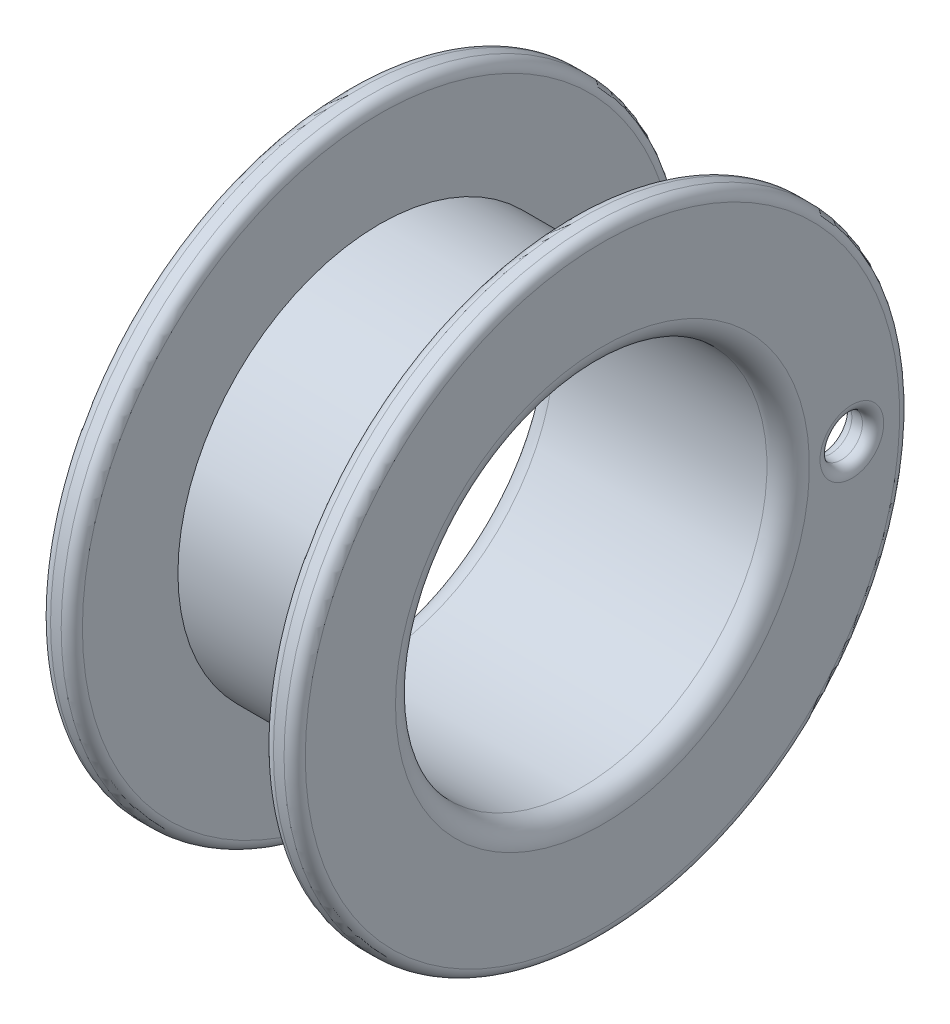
ISO-10303-21;
HEADER;
FILE_DESCRIPTION(('STEP AP214'),'2;1');
FILE_NAME('part.step','',(''),(''),'','','');
FILE_SCHEMA(('AUTOMOTIVE_DESIGN { 1 0 10303 214 1 1 1 1 }'));
ENDSEC;
DATA;
#1=APPLICATION_CONTEXT('core data for automotive mechanical design processes');
#2=APPLICATION_PROTOCOL_DEFINITION('international standard','automotive_design',2000,#1);
#3=PRODUCT_CONTEXT('',#1,'mechanical');
#4=PRODUCT('Part','Part','',(#3));
#5=PRODUCT_RELATED_PRODUCT_CATEGORY('part','',(#4));
#6=PRODUCT_DEFINITION_FORMATION('','',#4);
#7=PRODUCT_DEFINITION_CONTEXT('part definition',#1,'design');
#8=PRODUCT_DEFINITION('design','',#6,#7);
#9=PRODUCT_DEFINITION_SHAPE('','',#8);
#10=(LENGTH_UNIT() NAMED_UNIT(*) SI_UNIT(.MILLI.,.METRE.));
#11=(NAMED_UNIT(*) PLANE_ANGLE_UNIT() SI_UNIT($,.RADIAN.));
#12=(NAMED_UNIT(*) SI_UNIT($,.STERADIAN.) SOLID_ANGLE_UNIT());
#13=UNCERTAINTY_MEASURE_WITH_UNIT(LENGTH_MEASURE(1.E-05),#10,'distance_accuracy_value','');
#14=(GEOMETRIC_REPRESENTATION_CONTEXT(3) GLOBAL_UNCERTAINTY_ASSIGNED_CONTEXT((#13)) GLOBAL_UNIT_ASSIGNED_CONTEXT((#10,
#11,#12)) REPRESENTATION_CONTEXT('',''));
#15=CARTESIAN_POINT('',(0.,0.,0.));
#16=DIRECTION('',(0.,0.,1.));
#17=DIRECTION('',(1.,0.,0.));
#18=AXIS2_PLACEMENT_3D('',#15,#16,#17);
#19=CARTESIAN_POINT('',(0.,0.,0.));
#20=DIRECTION('',(1.,0.,0.));
#21=DIRECTION('',(0.,0.,-1.));
#22=AXIS2_PLACEMENT_3D('',#19,#20,#21);
#23=PLANE('',#22);
#24=CARTESIAN_POINT('',(0.,0.,-23.5));
#25=DIRECTION('',(1.,0.,0.));
#26=DIRECTION('',(0.,0.,-1.));
#27=AXIS2_PLACEMENT_3D('',#24,#25,#26);
#28=CIRCLE('',#27,3.);
#29=CARTESIAN_POINT('',(0.,0.,-26.5));
#30=VERTEX_POINT('',#29);
#31=EDGE_CURVE('E42',#30,#30,#28,.T.);
#32=ORIENTED_EDGE('',*,*,#31,.T.);
#33=EDGE_LOOP('',(#32));
#34=FACE_BOUND('',#33,.T.);
#35=CARTESIAN_POINT('',(0.,0.,0.));
#36=DIRECTION('',(1.,0.,0.));
#37=DIRECTION('',(0.,0.,-1.));
#38=AXIS2_PLACEMENT_3D('',#35,#36,#37);
#39=CIRCLE('',#38,19.5);
#40=CARTESIAN_POINT('',(0.,0.,-19.5));
#41=VERTEX_POINT('',#40);
#42=EDGE_CURVE('E76',#41,#41,#39,.T.);
#43=ORIENTED_EDGE('',*,*,#42,.T.);
#44=EDGE_LOOP('',(#43));
#45=FACE_BOUND('',#44,.T.);
#46=CARTESIAN_POINT('',(0.,0.,0.));
#47=DIRECTION('',(1.,0.,0.));
#48=DIRECTION('',(0.,0.,-1.));
#49=AXIS2_PLACEMENT_3D('',#46,#47,#48);
#50=CIRCLE('',#49,28.);
#51=CARTESIAN_POINT('',(0.,0.,-28.));
#52=VERTEX_POINT('',#51);
#53=EDGE_CURVE('E100',#52,#52,#50,.F.);
#54=ORIENTED_EDGE('',*,*,#53,.T.);
#55=EDGE_LOOP('',(#54));
#56=FACE_BOUND('',#55,.T.);
#57=ADVANCED_FACE('F35',(#34,#45,#56),#23,.F.);
#58=CARTESIAN_POINT('',(0.,0.,0.));
#59=DIRECTION('',(-1.,0.,0.));
#60=DIRECTION('',(0.,0.,1.));
#61=AXIS2_PLACEMENT_3D('',#58,#59,#60);
#62=CYLINDRICAL_SURFACE('',#61,29.);
#63=CARTESIAN_POINT('',(1.,0.,0.));
#64=DIRECTION('',(1.,0.,0.));
#65=DIRECTION('',(0.,0.,-1.));
#66=AXIS2_PLACEMENT_3D('',#63,#64,#65);
#67=CIRCLE('',#66,29.);
#68=CARTESIAN_POINT('',(0.999999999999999,0.,-29.));
#69=VERTEX_POINT('',#68);
#70=EDGE_CURVE('E94',#69,#69,#67,.T.);
#71=ORIENTED_EDGE('',*,*,#70,.T.);
#72=EDGE_LOOP('',(#71));
#73=FACE_BOUND('',#72,.T.);
#74=CARTESIAN_POINT('',(2.,0.,0.));
#75=DIRECTION('',(-1.,0.,0.));
#76=DIRECTION('',(0.,0.,1.));
#77=AXIS2_PLACEMENT_3D('',#74,#75,#76);
#78=CIRCLE('',#77,29.);
#79=CARTESIAN_POINT('',(2.,0.,29.));
#80=VERTEX_POINT('',#79);
#81=EDGE_CURVE('E97',#80,#80,#78,.T.);
#82=ORIENTED_EDGE('',*,*,#81,.T.);
#83=EDGE_LOOP('',(#82));
#84=FACE_BOUND('',#83,.T.);
#85=ADVANCED_FACE('F129',(#73,#84),#62,.T.);
#86=CARTESIAN_POINT('',(3.,0.,-29.));
#87=DIRECTION('',(-1.,0.,0.));
#88=DIRECTION('',(0.,0.,1.));
#89=AXIS2_PLACEMENT_3D('',#86,#87,#88);
#90=PLANE('',#89);
#91=CARTESIAN_POINT('',(3.,0.,-23.5));
#92=DIRECTION('',(-1.,0.,0.));
#93=DIRECTION('',(0.,0.,1.));
#94=AXIS2_PLACEMENT_3D('',#91,#92,#93);
#95=CIRCLE('',#94,3.);
#96=CARTESIAN_POINT('',(3.,0.,-20.5));
#97=VERTEX_POINT('',#96);
#98=EDGE_CURVE('E58',#97,#97,#95,.T.);
#99=ORIENTED_EDGE('',*,*,#98,.T.);
#100=EDGE_LOOP('',(#99));
#101=FACE_BOUND('',#100,.T.);
#102=CARTESIAN_POINT('',(3.,0.,0.));
#103=DIRECTION('',(-1.,0.,0.));
#104=DIRECTION('',(0.,0.,1.));
#105=AXIS2_PLACEMENT_3D('',#102,#103,#104);
#106=CIRCLE('',#105,28.);
#107=CARTESIAN_POINT('',(3.,0.,28.));
#108=VERTEX_POINT('',#107);
#109=EDGE_CURVE('E91',#108,#108,#106,.F.);
#110=ORIENTED_EDGE('',*,*,#109,.T.);
#111=EDGE_LOOP('',(#110));
#112=FACE_BOUND('',#111,.T.);
#113=CARTESIAN_POINT('',(3.,0.,0.));
#114=DIRECTION('',(-1.,0.,0.));
#115=DIRECTION('',(0.,0.,1.));
#116=AXIS2_PLACEMENT_3D('',#113,#114,#115);
#117=CIRCLE('',#116,19.);
#118=CARTESIAN_POINT('',(3.,0.,19.));
#119=VERTEX_POINT('',#118);
#120=EDGE_CURVE('E103',#119,#119,#117,.T.);
#121=ORIENTED_EDGE('',*,*,#120,.T.);
#122=EDGE_LOOP('',(#121));
#123=FACE_BOUND('',#122,.T.);
#124=ADVANCED_FACE('F124',(#101,#112,#123),#90,.F.);
#125=CARTESIAN_POINT('',(0.,0.,0.));
#126=DIRECTION('',(-1.,0.,0.));
#127=DIRECTION('',(0.,0.,1.));
#128=AXIS2_PLACEMENT_3D('',#125,#126,#127);
#129=CYLINDRICAL_SURFACE('',#128,19.);
#130=ORIENTED_EDGE('',*,*,#120,.F.);
#131=EDGE_LOOP('',(#130));
#132=FACE_BOUND('',#131,.T.);
#133=CARTESIAN_POINT('',(21.,0.,0.));
#134=DIRECTION('',(-1.,0.,0.));
#135=DIRECTION('',(0.,0.,1.));
#136=AXIS2_PLACEMENT_3D('',#133,#134,#135);
#137=CIRCLE('',#136,19.);
#138=CARTESIAN_POINT('',(21.,0.,19.));
#139=VERTEX_POINT('',#138);
#140=EDGE_CURVE('E106',#139,#139,#137,.T.);
#141=ORIENTED_EDGE('',*,*,#140,.T.);
#142=EDGE_LOOP('',(#141));
#143=FACE_BOUND('',#142,.T.);
#144=ADVANCED_FACE('F110',(#132,#143),#129,.T.);
#145=CARTESIAN_POINT('',(21.,0.,-19.));
#146=DIRECTION('',(1.,0.,0.));
#147=DIRECTION('',(0.,0.,-1.));
#148=AXIS2_PLACEMENT_3D('',#145,#146,#147);
#149=PLANE('',#148);
#150=CARTESIAN_POINT('',(21.,0.,-23.5));
#151=DIRECTION('',(1.,0.,0.));
#152=DIRECTION('',(0.,0.,-1.));
#153=AXIS2_PLACEMENT_3D('',#150,#151,#152);
#154=CIRCLE('',#153,3.);
#155=CARTESIAN_POINT('',(21.,0.,-26.5));
#156=VERTEX_POINT('',#155);
#157=EDGE_CURVE('E46',#156,#156,#154,.T.);
#158=ORIENTED_EDGE('',*,*,#157,.T.);
#159=EDGE_LOOP('',(#158));
#160=FACE_BOUND('',#159,.T.);
#161=CARTESIAN_POINT('',(21.,0.,0.));
#162=DIRECTION('',(1.,0.,0.));
#163=DIRECTION('',(0.,0.,-1.));
#164=AXIS2_PLACEMENT_3D('',#161,#162,#163);
#165=CIRCLE('',#164,28.);
#166=CARTESIAN_POINT('',(21.,0.,-28.));
#167=VERTEX_POINT('',#166);
#168=EDGE_CURVE('E88',#167,#167,#165,.F.);
#169=ORIENTED_EDGE('',*,*,#168,.T.);
#170=EDGE_LOOP('',(#169));
#171=FACE_BOUND('',#170,.T.);
#172=ORIENTED_EDGE('',*,*,#140,.F.);
#173=EDGE_LOOP('',(#172));
#174=FACE_BOUND('',#173,.T.);
#175=ADVANCED_FACE('F112',(#160,#171,#174),#149,.F.);
#176=CARTESIAN_POINT('',(0.,0.,0.));
#177=DIRECTION('',(-1.,0.,0.));
#178=DIRECTION('',(0.,0.,1.));
#179=AXIS2_PLACEMENT_3D('',#176,#177,#178);
#180=CYLINDRICAL_SURFACE('',#179,29.);
#181=CARTESIAN_POINT('',(22.,0.,0.));
#182=DIRECTION('',(1.,0.,0.));
#183=DIRECTION('',(0.,0.,-1.));
#184=AXIS2_PLACEMENT_3D('',#181,#182,#183);
#185=CIRCLE('',#184,29.);
#186=CARTESIAN_POINT('',(22.,0.,-29.));
#187=VERTEX_POINT('',#186);
#188=EDGE_CURVE('E82',#187,#187,#185,.T.);
#189=ORIENTED_EDGE('',*,*,#188,.T.);
#190=EDGE_LOOP('',(#189));
#191=FACE_BOUND('',#190,.T.);
#192=CARTESIAN_POINT('',(23.,0.,0.));
#193=DIRECTION('',(-1.,0.,0.));
#194=DIRECTION('',(0.,0.,1.));
#195=AXIS2_PLACEMENT_3D('',#192,#193,#194);
#196=CIRCLE('',#195,29.);
#197=CARTESIAN_POINT('',(23.,0.,29.));
#198=VERTEX_POINT('',#197);
#199=EDGE_CURVE('E85',#198,#198,#196,.T.);
#200=ORIENTED_EDGE('',*,*,#199,.T.);
#201=EDGE_LOOP('',(#200));
#202=FACE_BOUND('',#201,.T.);
#203=ADVANCED_FACE('F114',(#191,#202),#180,.T.);
#204=CARTESIAN_POINT('',(24.,0.,-29.));
#205=DIRECTION('',(-1.,0.,0.));
#206=DIRECTION('',(0.,0.,1.));
#207=AXIS2_PLACEMENT_3D('',#204,#205,#206);
#208=PLANE('',#207);
#209=CARTESIAN_POINT('',(24.,0.,-23.5));
#210=DIRECTION('',(-1.,0.,0.));
#211=DIRECTION('',(0.,0.,1.));
#212=AXIS2_PLACEMENT_3D('',#209,#210,#211);
#213=CIRCLE('',#212,3.);
#214=CARTESIAN_POINT('',(24.,0.,-20.5));
#215=VERTEX_POINT('',#214);
#216=EDGE_CURVE('E10',#215,#215,#213,.T.);
#217=ORIENTED_EDGE('',*,*,#216,.T.);
#218=EDGE_LOOP('',(#217));
#219=FACE_BOUND('',#218,.T.);
#220=CARTESIAN_POINT('',(24.,0.,0.));
#221=DIRECTION('',(-1.,0.,0.));
#222=DIRECTION('',(0.,0.,1.));
#223=AXIS2_PLACEMENT_3D('',#220,#221,#222);
#224=CIRCLE('',#223,19.5);
#225=CARTESIAN_POINT('',(24.,0.,19.5));
#226=VERTEX_POINT('',#225);
#227=EDGE_CURVE('E67',#226,#226,#224,.T.);
#228=ORIENTED_EDGE('',*,*,#227,.T.);
#229=EDGE_LOOP('',(#228));
#230=FACE_BOUND('',#229,.T.);
#231=CARTESIAN_POINT('',(24.,0.,0.));
#232=DIRECTION('',(-1.,0.,0.));
#233=DIRECTION('',(0.,0.,1.));
#234=AXIS2_PLACEMENT_3D('',#231,#232,#233);
#235=CIRCLE('',#234,28.);
#236=CARTESIAN_POINT('',(24.,0.,28.));
#237=VERTEX_POINT('',#236);
#238=EDGE_CURVE('E79',#237,#237,#235,.F.);
#239=ORIENTED_EDGE('',*,*,#238,.T.);
#240=EDGE_LOOP('',(#239));
#241=FACE_BOUND('',#240,.T.);
#242=ADVANCED_FACE('F121',(#219,#230,#241),#208,.F.);
#243=CARTESIAN_POINT('',(24.,0.,0.));
#244=DIRECTION('',(-1.,0.,0.));
#245=DIRECTION('',(0.,0.,1.));
#246=AXIS2_PLACEMENT_3D('',#243,#244,#245);
#247=CYLINDRICAL_SURFACE('',#246,17.5);
#248=CARTESIAN_POINT('',(2.,0.,0.));
#249=DIRECTION('',(1.,0.,0.));
#250=DIRECTION('',(0.,0.,-1.));
#251=AXIS2_PLACEMENT_3D('',#248,#249,#250);
#252=CIRCLE('',#251,17.5);
#253=CARTESIAN_POINT('',(2.,0.,-17.5));
#254=VERTEX_POINT('',#253);
#255=EDGE_CURVE('E70',#254,#254,#252,.F.);
#256=ORIENTED_EDGE('',*,*,#255,.T.);
#257=EDGE_LOOP('',(#256));
#258=FACE_BOUND('',#257,.T.);
#259=CARTESIAN_POINT('',(22.,0.,0.));
#260=DIRECTION('',(-1.,0.,0.));
#261=DIRECTION('',(0.,0.,1.));
#262=AXIS2_PLACEMENT_3D('',#259,#260,#261);
#263=CIRCLE('',#262,17.5);
#264=CARTESIAN_POINT('',(22.,0.,17.5));
#265=VERTEX_POINT('',#264);
#266=EDGE_CURVE('E73',#265,#265,#263,.F.);
#267=ORIENTED_EDGE('',*,*,#266,.T.);
#268=EDGE_LOOP('',(#267));
#269=FACE_BOUND('',#268,.T.);
#270=ADVANCED_FACE('F143',(#258,#269),#247,.F.);
#271=CARTESIAN_POINT('',(1.,0.,0.));
#272=DIRECTION('',(1.,0.,0.));
#273=DIRECTION('',(0.,0.,-1.));
#274=AXIS2_PLACEMENT_3D('',#271,#272,#273);
#275=TOROIDAL_SURFACE('',#274,28.,1.);
#276=ORIENTED_EDGE('',*,*,#70,.F.);
#277=EDGE_LOOP('',(#276));
#278=FACE_BOUND('',#277,.T.);
#279=ORIENTED_EDGE('',*,*,#53,.F.);
#280=EDGE_LOOP('',(#279));
#281=FACE_BOUND('',#280,.T.);
#282=ADVANCED_FACE('F139',(#278,#281),#275,.T.);
#283=CARTESIAN_POINT('',(2.,0.,0.));
#284=DIRECTION('',(-1.,0.,0.));
#285=DIRECTION('',(0.,0.,1.));
#286=AXIS2_PLACEMENT_3D('',#283,#284,#285);
#287=TOROIDAL_SURFACE('',#286,28.,1.);
#288=ORIENTED_EDGE('',*,*,#109,.F.);
#289=EDGE_LOOP('',(#288));
#290=FACE_BOUND('',#289,.T.);
#291=ORIENTED_EDGE('',*,*,#81,.F.);
#292=EDGE_LOOP('',(#291));
#293=FACE_BOUND('',#292,.T.);
#294=ADVANCED_FACE('F142',(#290,#293),#287,.T.);
#295=CARTESIAN_POINT('',(22.,0.,0.));
#296=DIRECTION('',(1.,0.,0.));
#297=DIRECTION('',(0.,0.,-1.));
#298=AXIS2_PLACEMENT_3D('',#295,#296,#297);
#299=TOROIDAL_SURFACE('',#298,28.,1.);
#300=ORIENTED_EDGE('',*,*,#188,.F.);
#301=EDGE_LOOP('',(#300));
#302=FACE_BOUND('',#301,.T.);
#303=ORIENTED_EDGE('',*,*,#168,.F.);
#304=EDGE_LOOP('',(#303));
#305=FACE_BOUND('',#304,.T.);
#306=ADVANCED_FACE('F147',(#302,#305),#299,.T.);
#307=CARTESIAN_POINT('',(23.,0.,0.));
#308=DIRECTION('',(-1.,0.,0.));
#309=DIRECTION('',(0.,0.,1.));
#310=AXIS2_PLACEMENT_3D('',#307,#308,#309);
#311=TOROIDAL_SURFACE('',#310,28.,1.);
#312=ORIENTED_EDGE('',*,*,#238,.F.);
#313=EDGE_LOOP('',(#312));
#314=FACE_BOUND('',#313,.T.);
#315=ORIENTED_EDGE('',*,*,#199,.F.);
#316=EDGE_LOOP('',(#315));
#317=FACE_BOUND('',#316,.T.);
#318=ADVANCED_FACE('F151',(#314,#317),#311,.T.);
#319=CARTESIAN_POINT('',(2.,0.,0.));
#320=DIRECTION('',(1.,0.,0.));
#321=DIRECTION('',(0.,0.,-1.));
#322=AXIS2_PLACEMENT_3D('',#319,#320,#321);
#323=TOROIDAL_SURFACE('',#322,19.5,2.);
#324=ORIENTED_EDGE('',*,*,#255,.F.);
#325=EDGE_LOOP('',(#324));
#326=FACE_BOUND('',#325,.T.);
#327=ORIENTED_EDGE('',*,*,#42,.F.);
#328=EDGE_LOOP('',(#327));
#329=FACE_BOUND('',#328,.T.);
#330=ADVANCED_FACE('F155',(#326,#329),#323,.T.);
#331=CARTESIAN_POINT('',(22.,0.,0.));
#332=DIRECTION('',(-1.,0.,0.));
#333=DIRECTION('',(0.,0.,1.));
#334=AXIS2_PLACEMENT_3D('',#331,#332,#333);
#335=TOROIDAL_SURFACE('',#334,19.5,2.);
#336=ORIENTED_EDGE('',*,*,#227,.F.);
#337=EDGE_LOOP('',(#336));
#338=FACE_BOUND('',#337,.T.);
#339=ORIENTED_EDGE('',*,*,#266,.F.);
#340=EDGE_LOOP('',(#339));
#341=FACE_BOUND('',#340,.T.);
#342=ADVANCED_FACE('F159',(#338,#341),#335,.T.);
#343=CARTESIAN_POINT('',(24.,0.,-23.5));
#344=DIRECTION('',(-1.,0.,0.));
#345=DIRECTION('',(0.,0.,1.));
#346=AXIS2_PLACEMENT_3D('',#343,#344,#345);
#347=CYLINDRICAL_SURFACE('',#346,2.);
#348=CARTESIAN_POINT('',(22.,0.,-23.5));
#349=DIRECTION('',(1.,0.,0.));
#350=DIRECTION('',(0.,0.,-1.));
#351=AXIS2_PLACEMENT_3D('',#348,#349,#350);
#352=CIRCLE('',#351,2.);
#353=CARTESIAN_POINT('',(22.,0.,-25.5));
#354=VERTEX_POINT('',#353);
#355=EDGE_CURVE('E50',#354,#354,#352,.F.);
#356=ORIENTED_EDGE('',*,*,#355,.T.);
#357=EDGE_LOOP('',(#356));
#358=FACE_BOUND('',#357,.T.);
#359=CARTESIAN_POINT('',(23.,0.,-23.5));
#360=DIRECTION('',(-1.,0.,0.));
#361=DIRECTION('',(0.,0.,1.));
#362=AXIS2_PLACEMENT_3D('',#359,#360,#361);
#363=CIRCLE('',#362,2.);
#364=CARTESIAN_POINT('',(23.,0.,-21.5));
#365=VERTEX_POINT('',#364);
#366=EDGE_CURVE('E55',#365,#365,#363,.F.);
#367=ORIENTED_EDGE('',*,*,#366,.T.);
#368=EDGE_LOOP('',(#367));
#369=FACE_BOUND('',#368,.T.);
#370=ADVANCED_FACE('F163',(#358,#369),#347,.F.);
#371=CARTESIAN_POINT('',(2.,0.,-23.5));
#372=DIRECTION('',(-1.,0.,0.));
#373=DIRECTION('',(0.,0.,1.));
#374=AXIS2_PLACEMENT_3D('',#371,#372,#373);
#375=CIRCLE('',#374,2.);
#376=CARTESIAN_POINT('',(2.,0.,-21.5));
#377=VERTEX_POINT('',#376);
#378=EDGE_CURVE('E61',#377,#377,#375,.F.);
#379=ORIENTED_EDGE('',*,*,#378,.T.);
#380=EDGE_LOOP('',(#379));
#381=FACE_BOUND('',#380,.T.);
#382=CARTESIAN_POINT('',(1.,0.,-23.5));
#383=DIRECTION('',(1.,0.,0.));
#384=DIRECTION('',(0.,0.,-1.));
#385=AXIS2_PLACEMENT_3D('',#382,#383,#384);
#386=CIRCLE('',#385,2.);
#387=CARTESIAN_POINT('',(1.,0.,-25.5));
#388=VERTEX_POINT('',#387);
#389=EDGE_CURVE('E64',#388,#388,#386,.F.);
#390=ORIENTED_EDGE('',*,*,#389,.T.);
#391=EDGE_LOOP('',(#390));
#392=FACE_BOUND('',#391,.T.);
#393=ADVANCED_FACE('F169',(#381,#392),#347,.F.);
#394=CARTESIAN_POINT('',(2.,0.,-23.5));
#395=DIRECTION('',(-1.,0.,0.));
#396=DIRECTION('',(0.,0.,1.));
#397=AXIS2_PLACEMENT_3D('',#394,#395,#396);
#398=TOROIDAL_SURFACE('',#397,3.,1.);
#399=ORIENTED_EDGE('',*,*,#98,.F.);
#400=EDGE_LOOP('',(#399));
#401=FACE_BOUND('',#400,.T.);
#402=ORIENTED_EDGE('',*,*,#378,.F.);
#403=EDGE_LOOP('',(#402));
#404=FACE_BOUND('',#403,.T.);
#405=ADVANCED_FACE('F165',(#401,#404),#398,.T.);
#406=CARTESIAN_POINT('',(22.,0.,-23.5));
#407=DIRECTION('',(1.,0.,0.));
#408=DIRECTION('',(0.,0.,-1.));
#409=AXIS2_PLACEMENT_3D('',#406,#407,#408);
#410=TOROIDAL_SURFACE('',#409,3.,1.);
#411=ORIENTED_EDGE('',*,*,#157,.F.);
#412=EDGE_LOOP('',(#411));
#413=FACE_BOUND('',#412,.T.);
#414=ORIENTED_EDGE('',*,*,#355,.F.);
#415=EDGE_LOOP('',(#414));
#416=FACE_BOUND('',#415,.T.);
#417=ADVANCED_FACE('F168',(#413,#416),#410,.T.);
#418=CARTESIAN_POINT('',(1.,0.,-23.5));
#419=DIRECTION('',(1.,0.,0.));
#420=DIRECTION('',(0.,0.,-1.));
#421=AXIS2_PLACEMENT_3D('',#418,#419,#420);
#422=TOROIDAL_SURFACE('',#421,3.,1.);
#423=ORIENTED_EDGE('',*,*,#389,.F.);
#424=EDGE_LOOP('',(#423));
#425=FACE_BOUND('',#424,.T.);
#426=ORIENTED_EDGE('',*,*,#31,.F.);
#427=EDGE_LOOP('',(#426));
#428=FACE_BOUND('',#427,.T.);
#429=ADVANCED_FACE('F172',(#425,#428),#422,.T.);
#430=CARTESIAN_POINT('',(23.,0.,-23.5));
#431=DIRECTION('',(-1.,0.,0.));
#432=DIRECTION('',(0.,0.,1.));
#433=AXIS2_PLACEMENT_3D('',#430,#431,#432);
#434=TOROIDAL_SURFACE('',#433,3.,1.);
#435=ORIENTED_EDGE('',*,*,#216,.F.);
#436=EDGE_LOOP('',(#435));
#437=FACE_BOUND('',#436,.T.);
#438=ORIENTED_EDGE('',*,*,#366,.F.);
#439=EDGE_LOOP('',(#438));
#440=FACE_BOUND('',#439,.T.);
#441=ADVANCED_FACE('F37',(#437,#440),#434,.T.);
#442=CLOSED_SHELL('',(#57,#85,#124,#144,#175,#203,#242,#270,#282,#294,#306,#318,#330,#342,#370,
#393,#405,#417,#429,#441));
#443=MANIFOLD_SOLID_BREP('B2',#442);
#444=ADVANCED_BREP_SHAPE_REPRESENTATION('',(#18,#443),#14);
#445=SHAPE_DEFINITION_REPRESENTATION(#9,#444);
ENDSEC;
END-ISO-10303-21;
